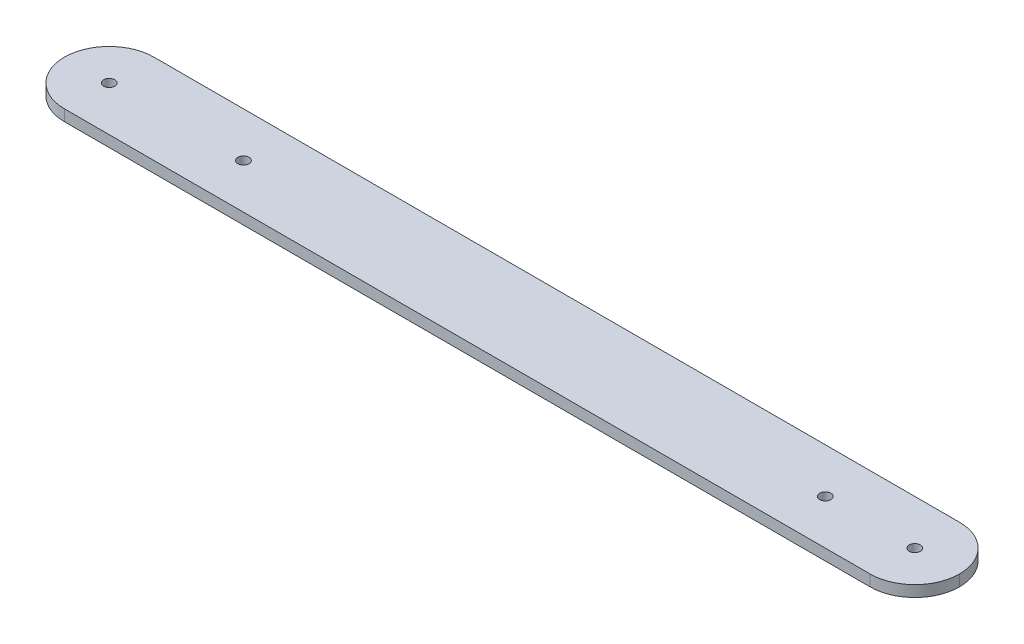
ISO-10303-21;
HEADER;
FILE_DESCRIPTION(('STEP AP214'),'2;1');
FILE_NAME('part.step','',(''),(''),'','','');
FILE_SCHEMA(('AUTOMOTIVE_DESIGN { 1 0 10303 214 1 1 1 1 }'));
ENDSEC;
DATA;
#1=APPLICATION_CONTEXT('core data for automotive mechanical design processes');
#2=APPLICATION_PROTOCOL_DEFINITION('international standard','automotive_design',2000,#1);
#3=PRODUCT_CONTEXT('',#1,'mechanical');
#4=PRODUCT('Part','Part','',(#3));
#5=PRODUCT_RELATED_PRODUCT_CATEGORY('part','',(#4));
#6=PRODUCT_DEFINITION_FORMATION('','',#4);
#7=PRODUCT_DEFINITION_CONTEXT('part definition',#1,'design');
#8=PRODUCT_DEFINITION('design','',#6,#7);
#9=PRODUCT_DEFINITION_SHAPE('','',#8);
#10=(LENGTH_UNIT() NAMED_UNIT(*) SI_UNIT(.MILLI.,.METRE.));
#11=(NAMED_UNIT(*) PLANE_ANGLE_UNIT() SI_UNIT($,.RADIAN.));
#12=(NAMED_UNIT(*) SI_UNIT($,.STERADIAN.) SOLID_ANGLE_UNIT());
#13=UNCERTAINTY_MEASURE_WITH_UNIT(LENGTH_MEASURE(1.E-05),#10,'distance_accuracy_value','');
#14=(GEOMETRIC_REPRESENTATION_CONTEXT(3) GLOBAL_UNCERTAINTY_ASSIGNED_CONTEXT((#13)) GLOBAL_UNIT_ASSIGNED_CONTEXT((#10,
#11,#12)) REPRESENTATION_CONTEXT('',''));
#15=CARTESIAN_POINT('',(0.,0.,0.));
#16=DIRECTION('',(0.,0.,1.));
#17=DIRECTION('',(1.,0.,0.));
#18=AXIS2_PLACEMENT_3D('',#15,#16,#17);
#19=CARTESIAN_POINT('',(0.,3.175,0.));
#20=DIRECTION('',(0.,0.,-1.));
#21=DIRECTION('',(-1.,0.,0.));
#22=AXIS2_PLACEMENT_3D('',#19,#20,#21);
#23=PLANE('',#22);
#24=DIRECTION('',(1.,0.,0.));
#25=VECTOR('',#24,1.);
#26=CARTESIAN_POINT('',(0.,0.,0.));
#27=LINE('',#26,#25);
#28=CARTESIAN_POINT('',(12.7,0.,0.));
#29=VERTEX_POINT('',#28);
#30=CARTESIAN_POINT('',(241.3,0.,0.));
#31=VERTEX_POINT('',#30);
#32=EDGE_CURVE('E114',#29,#31,#27,.T.);
#33=ORIENTED_EDGE('',*,*,#32,.T.);
#34=DIRECTION('',(0.,-1.,0.));
#35=VECTOR('',#34,1.);
#36=CARTESIAN_POINT('',(241.3,3.175,0.));
#37=LINE('',#36,#35);
#38=CARTESIAN_POINT('',(241.3,3.175,0.));
#39=VERTEX_POINT('',#38);
#40=EDGE_CURVE('E11',#31,#39,#37,.F.);
#41=ORIENTED_EDGE('',*,*,#40,.T.);
#42=DIRECTION('',(1.,0.,0.));
#43=VECTOR('',#42,1.);
#44=CARTESIAN_POINT('',(0.,3.175,0.));
#45=LINE('',#44,#43);
#46=CARTESIAN_POINT('',(12.7,3.175,0.));
#47=VERTEX_POINT('',#46);
#48=EDGE_CURVE('E113',#47,#39,#45,.T.);
#49=ORIENTED_EDGE('',*,*,#48,.F.);
#50=DIRECTION('',(0.,-1.,0.));
#51=VECTOR('',#50,1.);
#52=CARTESIAN_POINT('',(12.7,3.175,0.));
#53=LINE('',#52,#51);
#54=EDGE_CURVE('E42',#47,#29,#53,.T.);
#55=ORIENTED_EDGE('',*,*,#54,.T.);
#56=EDGE_LOOP('',(#33,#41,#49,#55));
#57=FACE_BOUND('',#56,.T.);
#58=ADVANCED_FACE('F33',(#57),#23,.F.);
#59=CARTESIAN_POINT('',(0.,3.175,-25.4));
#60=DIRECTION('',(0.,0.,1.));
#61=DIRECTION('',(1.,0.,0.));
#62=AXIS2_PLACEMENT_3D('',#59,#60,#61);
#63=PLANE('',#62);
#64=DIRECTION('',(-1.,0.,0.));
#65=VECTOR('',#64,1.);
#66=CARTESIAN_POINT('',(0.,3.175,-25.4));
#67=LINE('',#66,#65);
#68=CARTESIAN_POINT('',(241.3,3.175,-25.4));
#69=VERTEX_POINT('',#68);
#70=CARTESIAN_POINT('',(12.7,3.175,-25.4));
#71=VERTEX_POINT('',#70);
#72=EDGE_CURVE('E107',#69,#71,#67,.T.);
#73=ORIENTED_EDGE('',*,*,#72,.F.);
#74=DIRECTION('',(0.,-1.,0.));
#75=VECTOR('',#74,1.);
#76=CARTESIAN_POINT('',(241.3,3.175,-25.4));
#77=LINE('',#76,#75);
#78=CARTESIAN_POINT('',(241.3,0.,-25.4));
#79=VERTEX_POINT('',#78);
#80=EDGE_CURVE('E92',#69,#79,#77,.T.);
#81=ORIENTED_EDGE('',*,*,#80,.T.);
#82=DIRECTION('',(-1.,0.,0.));
#83=VECTOR('',#82,1.);
#84=CARTESIAN_POINT('',(0.,0.,-25.4));
#85=LINE('',#84,#83);
#86=CARTESIAN_POINT('',(12.7,0.,-25.4));
#87=VERTEX_POINT('',#86);
#88=EDGE_CURVE('E104',#79,#87,#85,.T.);
#89=ORIENTED_EDGE('',*,*,#88,.T.);
#90=DIRECTION('',(0.,-1.,0.));
#91=VECTOR('',#90,1.);
#92=CARTESIAN_POINT('',(12.7,3.175,-25.4));
#93=LINE('',#92,#91);
#94=EDGE_CURVE('E109',#87,#71,#93,.F.);
#95=ORIENTED_EDGE('',*,*,#94,.T.);
#96=EDGE_LOOP('',(#73,#81,#89,#95));
#97=FACE_BOUND('',#96,.T.);
#98=ADVANCED_FACE('F103',(#97),#63,.F.);
#99=CARTESIAN_POINT('',(0.,3.175,0.));
#100=DIRECTION('',(0.,-1.,0.));
#101=DIRECTION('',(0.,0.,-1.));
#102=AXIS2_PLACEMENT_3D('',#99,#100,#101);
#103=PLANE('',#102);
#104=CARTESIAN_POINT('',(241.3,3.175,-12.7));
#105=DIRECTION('',(0.,1.,0.));
#106=DIRECTION('',(0.,0.,1.));
#107=AXIS2_PLACEMENT_3D('',#104,#105,#106);
#108=CIRCLE('',#107,1.58749999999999);
#109=CARTESIAN_POINT('',(241.3,3.175,-11.1125));
#110=VERTEX_POINT('',#109);
#111=EDGE_CURVE('E140',#110,#110,#108,.T.);
#112=ORIENTED_EDGE('',*,*,#111,.F.);
#113=EDGE_LOOP('',(#112));
#114=FACE_BOUND('',#113,.T.);
#115=CARTESIAN_POINT('',(215.9,3.175,-12.7));
#116=DIRECTION('',(0.,1.,0.));
#117=DIRECTION('',(0.,0.,1.));
#118=AXIS2_PLACEMENT_3D('',#115,#116,#117);
#119=CIRCLE('',#118,1.58749999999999);
#120=CARTESIAN_POINT('',(215.9,3.175,-11.1125));
#121=VERTEX_POINT('',#120);
#122=EDGE_CURVE('E145',#121,#121,#119,.T.);
#123=ORIENTED_EDGE('',*,*,#122,.F.);
#124=EDGE_LOOP('',(#123));
#125=FACE_BOUND('',#124,.T.);
#126=CARTESIAN_POINT('',(12.7,3.175,-12.7));
#127=DIRECTION('',(0.,1.,0.));
#128=DIRECTION('',(0.,0.,1.));
#129=AXIS2_PLACEMENT_3D('',#126,#127,#128);
#130=CIRCLE('',#129,1.5875);
#131=CARTESIAN_POINT('',(12.7,3.175,-11.1125));
#132=VERTEX_POINT('',#131);
#133=EDGE_CURVE('E154',#132,#132,#130,.T.);
#134=ORIENTED_EDGE('',*,*,#133,.F.);
#135=EDGE_LOOP('',(#134));
#136=FACE_BOUND('',#135,.T.);
#137=CARTESIAN_POINT('',(50.8,3.175,-12.7));
#138=DIRECTION('',(0.,1.,0.));
#139=DIRECTION('',(0.,0.,1.));
#140=AXIS2_PLACEMENT_3D('',#137,#138,#139);
#141=CIRCLE('',#140,1.5875);
#142=CARTESIAN_POINT('',(50.8,3.175,-11.1125));
#143=VERTEX_POINT('',#142);
#144=EDGE_CURVE('E135',#143,#143,#141,.T.);
#145=ORIENTED_EDGE('',*,*,#144,.F.);
#146=EDGE_LOOP('',(#145));
#147=FACE_BOUND('',#146,.T.);
#148=CARTESIAN_POINT('',(241.3,3.175,-12.7));
#149=DIRECTION('',(0.,-1.,0.));
#150=DIRECTION('',(0.,0.,-1.));
#151=AXIS2_PLACEMENT_3D('',#148,#149,#150);
#152=CIRCLE('',#151,12.7);
#153=CARTESIAN_POINT('',(254.,3.175,-12.7));
#154=VERTEX_POINT('',#153);
#155=EDGE_CURVE('E50',#39,#154,#152,.F.);
#156=ORIENTED_EDGE('',*,*,#155,.T.);
#157=CARTESIAN_POINT('',(241.3,3.175,-12.7));
#158=DIRECTION('',(0.,-1.,0.));
#159=DIRECTION('',(0.,0.,-1.));
#160=AXIS2_PLACEMENT_3D('',#157,#158,#159);
#161=CIRCLE('',#160,12.7);
#162=EDGE_CURVE('E130',#154,#69,#161,.F.);
#163=ORIENTED_EDGE('',*,*,#162,.T.);
#164=ORIENTED_EDGE('',*,*,#72,.T.);
#165=CARTESIAN_POINT('',(12.7,3.175,-12.7));
#166=DIRECTION('',(0.,-1.,0.));
#167=DIRECTION('',(0.,0.,-1.));
#168=AXIS2_PLACEMENT_3D('',#165,#166,#167);
#169=CIRCLE('',#168,12.7);
#170=CARTESIAN_POINT('',(0.,3.175,-12.7));
#171=VERTEX_POINT('',#170);
#172=EDGE_CURVE('E97',#71,#171,#169,.F.);
#173=ORIENTED_EDGE('',*,*,#172,.T.);
#174=CARTESIAN_POINT('',(12.7,3.175,-12.7));
#175=DIRECTION('',(0.,-1.,0.));
#176=DIRECTION('',(0.,0.,-1.));
#177=AXIS2_PLACEMENT_3D('',#174,#175,#176);
#178=CIRCLE('',#177,12.7);
#179=EDGE_CURVE('E127',#171,#47,#178,.F.);
#180=ORIENTED_EDGE('',*,*,#179,.T.);
#181=ORIENTED_EDGE('',*,*,#48,.T.);
#182=EDGE_LOOP('',(#156,#163,#164,#173,#180,#181));
#183=FACE_BOUND('',#182,.T.);
#184=ADVANCED_FACE('F162',(#114,#125,#136,#147,#183),#103,.F.);
#185=CARTESIAN_POINT('',(0.,0.,0.));
#186=DIRECTION('',(0.,-1.,0.));
#187=DIRECTION('',(0.,0.,-1.));
#188=AXIS2_PLACEMENT_3D('',#185,#186,#187);
#189=PLANE('',#188);
#190=CARTESIAN_POINT('',(241.3,0.,-12.7));
#191=DIRECTION('',(0.,-1.,0.));
#192=DIRECTION('',(0.,0.,-1.));
#193=AXIS2_PLACEMENT_3D('',#190,#191,#192);
#194=CIRCLE('',#193,1.58749999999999);
#195=CARTESIAN_POINT('',(241.3,0.,-14.2875));
#196=VERTEX_POINT('',#195);
#197=EDGE_CURVE('E37',#196,#196,#194,.T.);
#198=ORIENTED_EDGE('',*,*,#197,.F.);
#199=EDGE_LOOP('',(#198));
#200=FACE_BOUND('',#199,.T.);
#201=CARTESIAN_POINT('',(215.9,0.,-12.7));
#202=DIRECTION('',(0.,-1.,0.));
#203=DIRECTION('',(0.,0.,-1.));
#204=AXIS2_PLACEMENT_3D('',#201,#202,#203);
#205=CIRCLE('',#204,1.58749999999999);
#206=CARTESIAN_POINT('',(215.9,0.,-14.2875));
#207=VERTEX_POINT('',#206);
#208=EDGE_CURVE('E138',#207,#207,#205,.T.);
#209=ORIENTED_EDGE('',*,*,#208,.F.);
#210=EDGE_LOOP('',(#209));
#211=FACE_BOUND('',#210,.T.);
#212=CARTESIAN_POINT('',(12.7,0.,-12.7));
#213=DIRECTION('',(0.,1.,0.));
#214=DIRECTION('',(0.,0.,1.));
#215=AXIS2_PLACEMENT_3D('',#212,#213,#214);
#216=CIRCLE('',#215,1.5875);
#217=CARTESIAN_POINT('',(12.7,0.,-11.1125));
#218=VERTEX_POINT('',#217);
#219=EDGE_CURVE('E117',#218,#218,#216,.T.);
#220=ORIENTED_EDGE('',*,*,#219,.T.);
#221=EDGE_LOOP('',(#220));
#222=FACE_BOUND('',#221,.T.);
#223=CARTESIAN_POINT('',(50.8,0.,-12.7));
#224=DIRECTION('',(0.,1.,0.));
#225=DIRECTION('',(0.,0.,1.));
#226=AXIS2_PLACEMENT_3D('',#223,#224,#225);
#227=CIRCLE('',#226,1.5875);
#228=CARTESIAN_POINT('',(50.8,0.,-11.1125));
#229=VERTEX_POINT('',#228);
#230=EDGE_CURVE('E157',#229,#229,#227,.T.);
#231=ORIENTED_EDGE('',*,*,#230,.T.);
#232=EDGE_LOOP('',(#231));
#233=FACE_BOUND('',#232,.T.);
#234=ORIENTED_EDGE('',*,*,#88,.F.);
#235=CARTESIAN_POINT('',(241.3,0.,-12.7));
#236=DIRECTION('',(0.,-1.,0.));
#237=DIRECTION('',(0.,0.,-1.));
#238=AXIS2_PLACEMENT_3D('',#235,#236,#237);
#239=CIRCLE('',#238,12.7);
#240=CARTESIAN_POINT('',(254.,0.,-12.7));
#241=VERTEX_POINT('',#240);
#242=EDGE_CURVE('E88',#79,#241,#239,.T.);
#243=ORIENTED_EDGE('',*,*,#242,.T.);
#244=CARTESIAN_POINT('',(241.3,0.,-12.7));
#245=DIRECTION('',(0.,-1.,0.));
#246=DIRECTION('',(0.,0.,-1.));
#247=AXIS2_PLACEMENT_3D('',#244,#245,#246);
#248=CIRCLE('',#247,12.7);
#249=EDGE_CURVE('E98',#241,#31,#248,.T.);
#250=ORIENTED_EDGE('',*,*,#249,.T.);
#251=ORIENTED_EDGE('',*,*,#32,.F.);
#252=CARTESIAN_POINT('',(12.7,0.,-12.7));
#253=DIRECTION('',(0.,-1.,0.));
#254=DIRECTION('',(0.,0.,-1.));
#255=AXIS2_PLACEMENT_3D('',#252,#253,#254);
#256=CIRCLE('',#255,12.7);
#257=CARTESIAN_POINT('',(0.,0.,-12.7));
#258=VERTEX_POINT('',#257);
#259=EDGE_CURVE('E123',#29,#258,#256,.T.);
#260=ORIENTED_EDGE('',*,*,#259,.T.);
#261=CARTESIAN_POINT('',(12.7,0.,-12.7));
#262=DIRECTION('',(0.,-1.,0.));
#263=DIRECTION('',(0.,0.,-1.));
#264=AXIS2_PLACEMENT_3D('',#261,#262,#263);
#265=CIRCLE('',#264,12.7);
#266=EDGE_CURVE('E108',#258,#87,#265,.T.);
#267=ORIENTED_EDGE('',*,*,#266,.T.);
#268=EDGE_LOOP('',(#234,#243,#250,#251,#260,#267));
#269=FACE_BOUND('',#268,.T.);
#270=ADVANCED_FACE('F111',(#200,#211,#222,#233,#269),#189,.T.);
#271=CARTESIAN_POINT('',(50.8,0.,-12.7));
#272=DIRECTION('',(0.,1.,0.));
#273=DIRECTION('',(0.,0.,1.));
#274=AXIS2_PLACEMENT_3D('',#271,#272,#273);
#275=CYLINDRICAL_SURFACE('',#274,1.5875);
#276=ORIENTED_EDGE('',*,*,#230,.F.);
#277=EDGE_LOOP('',(#276));
#278=FACE_BOUND('',#277,.T.);
#279=ORIENTED_EDGE('',*,*,#144,.T.);
#280=EDGE_LOOP('',(#279));
#281=FACE_BOUND('',#280,.T.);
#282=ADVANCED_FACE('F180',(#278,#281),#275,.F.);
#283=CARTESIAN_POINT('',(12.7,0.,-12.7));
#284=DIRECTION('',(0.,1.,0.));
#285=DIRECTION('',(0.,0.,1.));
#286=AXIS2_PLACEMENT_3D('',#283,#284,#285);
#287=CYLINDRICAL_SURFACE('',#286,1.5875);
#288=ORIENTED_EDGE('',*,*,#219,.F.);
#289=EDGE_LOOP('',(#288));
#290=FACE_BOUND('',#289,.T.);
#291=ORIENTED_EDGE('',*,*,#133,.T.);
#292=EDGE_LOOP('',(#291));
#293=FACE_BOUND('',#292,.T.);
#294=ADVANCED_FACE('F173',(#290,#293),#287,.F.);
#295=CARTESIAN_POINT('',(241.3,3.175,-12.7));
#296=DIRECTION('',(0.,-1.,0.));
#297=DIRECTION('',(0.,0.,-1.));
#298=AXIS2_PLACEMENT_3D('',#295,#296,#297);
#299=CYLINDRICAL_SURFACE('',#298,12.7);
#300=DIRECTION('',(0.,-1.,0.));
#301=VECTOR('',#300,1.);
#302=CARTESIAN_POINT('',(254.,3.175,-12.7));
#303=LINE('',#302,#301);
#304=EDGE_CURVE('E93',#154,#241,#303,.T.);
#305=ORIENTED_EDGE('',*,*,#304,.F.);
#306=ORIENTED_EDGE('',*,*,#155,.F.);
#307=ORIENTED_EDGE('',*,*,#40,.F.);
#308=ORIENTED_EDGE('',*,*,#249,.F.);
#309=EDGE_LOOP('',(#305,#306,#307,#308));
#310=FACE_BOUND('',#309,.T.);
#311=ADVANCED_FACE('F171',(#310),#299,.T.);
#312=CARTESIAN_POINT('',(241.3,3.175,-12.7));
#313=DIRECTION('',(0.,-1.,0.));
#314=DIRECTION('',(0.,0.,-1.));
#315=AXIS2_PLACEMENT_3D('',#312,#313,#314);
#316=CYLINDRICAL_SURFACE('',#315,12.7);
#317=ORIENTED_EDGE('',*,*,#162,.F.);
#318=ORIENTED_EDGE('',*,*,#304,.T.);
#319=ORIENTED_EDGE('',*,*,#242,.F.);
#320=ORIENTED_EDGE('',*,*,#80,.F.);
#321=EDGE_LOOP('',(#317,#318,#319,#320));
#322=FACE_BOUND('',#321,.T.);
#323=ADVANCED_FACE('F91',(#322),#316,.T.);
#324=CARTESIAN_POINT('',(12.7,3.175,-12.7));
#325=DIRECTION('',(0.,-1.,0.));
#326=DIRECTION('',(0.,0.,-1.));
#327=AXIS2_PLACEMENT_3D('',#324,#325,#326);
#328=CYLINDRICAL_SURFACE('',#327,12.7);
#329=DIRECTION('',(0.,-1.,0.));
#330=VECTOR('',#329,1.);
#331=CARTESIAN_POINT('',(0.,3.175,-12.7));
#332=LINE('',#331,#330);
#333=EDGE_CURVE('E136',#171,#258,#332,.T.);
#334=ORIENTED_EDGE('',*,*,#333,.F.);
#335=ORIENTED_EDGE('',*,*,#172,.F.);
#336=ORIENTED_EDGE('',*,*,#94,.F.);
#337=ORIENTED_EDGE('',*,*,#266,.F.);
#338=EDGE_LOOP('',(#334,#335,#336,#337));
#339=FACE_BOUND('',#338,.T.);
#340=ADVANCED_FACE('F35',(#339),#328,.T.);
#341=CARTESIAN_POINT('',(12.7,3.175,-12.7));
#342=DIRECTION('',(0.,-1.,0.));
#343=DIRECTION('',(0.,0.,-1.));
#344=AXIS2_PLACEMENT_3D('',#341,#342,#343);
#345=CYLINDRICAL_SURFACE('',#344,12.7);
#346=ORIENTED_EDGE('',*,*,#179,.F.);
#347=ORIENTED_EDGE('',*,*,#333,.T.);
#348=ORIENTED_EDGE('',*,*,#259,.F.);
#349=ORIENTED_EDGE('',*,*,#54,.F.);
#350=EDGE_LOOP('',(#346,#347,#348,#349));
#351=FACE_BOUND('',#350,.T.);
#352=ADVANCED_FACE('F168',(#351),#345,.T.);
#353=CARTESIAN_POINT('',(215.9,-4.445,-12.7));
#354=DIRECTION('',(0.,1.,0.));
#355=DIRECTION('',(0.,0.,1.));
#356=AXIS2_PLACEMENT_3D('',#353,#354,#355);
#357=CYLINDRICAL_SURFACE('',#356,1.58749999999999);
#358=ORIENTED_EDGE('',*,*,#208,.T.);
#359=EDGE_LOOP('',(#358));
#360=FACE_BOUND('',#359,.T.);
#361=ORIENTED_EDGE('',*,*,#122,.T.);
#362=EDGE_LOOP('',(#361));
#363=FACE_BOUND('',#362,.T.);
#364=ADVANCED_FACE('F199',(#360,#363),#357,.F.);
#365=CARTESIAN_POINT('',(241.3,-4.445,-12.7));
#366=DIRECTION('',(0.,1.,0.));
#367=DIRECTION('',(0.,0.,1.));
#368=AXIS2_PLACEMENT_3D('',#365,#366,#367);
#369=CYLINDRICAL_SURFACE('',#368,1.58749999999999);
#370=ORIENTED_EDGE('',*,*,#197,.T.);
#371=EDGE_LOOP('',(#370));
#372=FACE_BOUND('',#371,.T.);
#373=ORIENTED_EDGE('',*,*,#111,.T.);
#374=EDGE_LOOP('',(#373));
#375=FACE_BOUND('',#374,.T.);
#376=ADVANCED_FACE('F202',(#372,#375),#369,.F.);
#377=CLOSED_SHELL('',(#58,#98,#184,#270,#282,#294,#311,#323,#340,#352,#364,#376));
#378=MANIFOLD_SOLID_BREP('B2',#377);
#379=ADVANCED_BREP_SHAPE_REPRESENTATION('',(#18,#378),#14);
#380=SHAPE_DEFINITION_REPRESENTATION(#9,#379);
ENDSEC;
END-ISO-10303-21;
